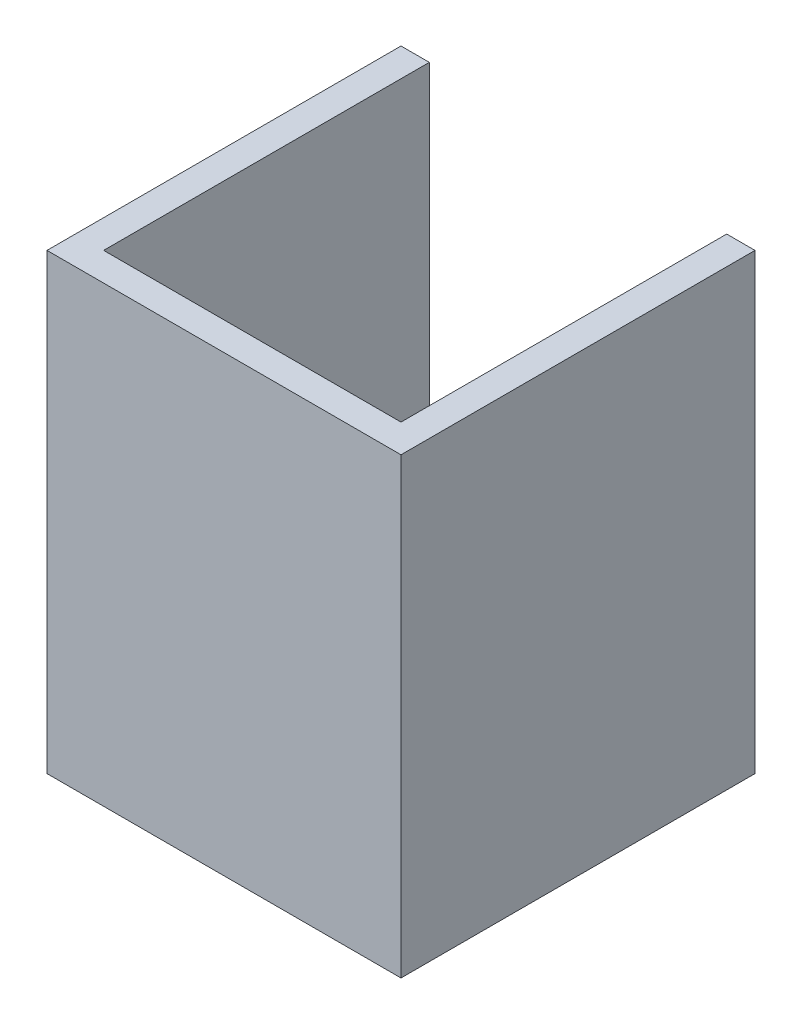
from build123d import *

# Parameters (mm, degrees)
SKETCH2_W           = 25
SKETCH2_H           = 32
BOSS_EXTRUDE1_DEPTH = 25
SHELL1_T            = -2
SKETCH3_W           = 10
SKETCH3_H           = 23
CUT_EXTRUDE1_DEPTH  = 47.368092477


with BuildPart() as part:
    # Sketch2 → Boss-Extrude1 (new body)
    with BuildSketch(Plane.XY):
        with Locations((12.5, 16)):
            Rectangle(SKETCH2_W, SKETCH2_H)
    extrude(amount=BOSS_EXTRUDE1_DEPTH)

    # Shell1
    shell1_openings = [part.faces().sort_by_distance(p)[0] for p in [
        (12.5, 16, 0),
        (12.5, 32, 12.5),
    ]]
    offset(amount=SHELL1_T, openings=shell1_openings, kind=Kind.INTERSECTION)

    # Sketch3 → Cut-Extrude1 (cut, through all)
    with BuildSketch(Plane(origin=(0, 2, 0), x_dir=(1, 0, 0), z_dir=(0, 1, 0))):
        with Locations((12.5, -11.5)):
            Rectangle(SKETCH3_W, SKETCH3_H)
    extrude(amount=-CUT_EXTRUDE1_DEPTH, mode=Mode.SUBTRACT)


solid = part.part
